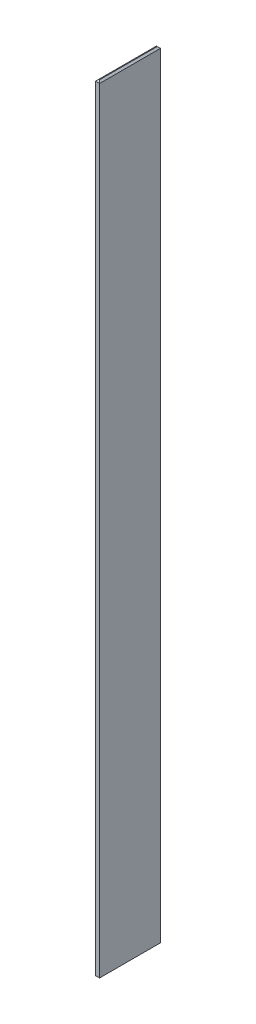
ISO-10303-21;
HEADER;
FILE_DESCRIPTION(('STEP AP214'),'2;1');
FILE_NAME('part.step','',(''),(''),'','','');
FILE_SCHEMA(('AUTOMOTIVE_DESIGN { 1 0 10303 214 1 1 1 1 }'));
ENDSEC;
DATA;
#1=APPLICATION_CONTEXT('core data for automotive mechanical design processes');
#2=APPLICATION_PROTOCOL_DEFINITION('international standard','automotive_design',2000,#1);
#3=PRODUCT_CONTEXT('',#1,'mechanical');
#4=PRODUCT('Part','Part','',(#3));
#5=PRODUCT_RELATED_PRODUCT_CATEGORY('part','',(#4));
#6=PRODUCT_DEFINITION_FORMATION('','',#4);
#7=PRODUCT_DEFINITION_CONTEXT('part definition',#1,'design');
#8=PRODUCT_DEFINITION('design','',#6,#7);
#9=PRODUCT_DEFINITION_SHAPE('','',#8);
#10=(LENGTH_UNIT() NAMED_UNIT(*) SI_UNIT(.MILLI.,.METRE.));
#11=(NAMED_UNIT(*) PLANE_ANGLE_UNIT() SI_UNIT($,.RADIAN.));
#12=(NAMED_UNIT(*) SI_UNIT($,.STERADIAN.) SOLID_ANGLE_UNIT());
#13=UNCERTAINTY_MEASURE_WITH_UNIT(LENGTH_MEASURE(1.E-05),#10,'distance_accuracy_value','');
#14=(GEOMETRIC_REPRESENTATION_CONTEXT(3) GLOBAL_UNCERTAINTY_ASSIGNED_CONTEXT((#13)) GLOBAL_UNIT_ASSIGNED_CONTEXT((#10,
#11,#12)) REPRESENTATION_CONTEXT('',''));
#15=CARTESIAN_POINT('',(0.,0.,0.));
#16=DIRECTION('',(0.,0.,1.));
#17=DIRECTION('',(1.,0.,0.));
#18=AXIS2_PLACEMENT_3D('',#15,#16,#17);
#19=CARTESIAN_POINT('',(-25.3999999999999,9739.6,380.999999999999));
#20=DIRECTION('',(1.,0.,0.));
#21=DIRECTION('',(0.,0.,-1.));
#22=AXIS2_PLACEMENT_3D('',#19,#20,#21);
#23=PLANE('',#22);
#24=DIRECTION('',(0.,-1.,0.));
#25=VECTOR('',#24,1.);
#26=CARTESIAN_POINT('',(-25.4000000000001,9739.6,-381.000000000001));
#27=LINE('',#26,#25);
#28=CARTESIAN_POINT('',(-25.4000000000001,9719.6,-381.000000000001));
#29=VERTEX_POINT('',#28);
#30=CARTESIAN_POINT('',(-25.4000000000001,20.0000000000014,-381.000000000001));
#31=VERTEX_POINT('',#30);
#32=EDGE_CURVE('E170',#29,#31,#27,.T.);
#33=ORIENTED_EDGE('',*,*,#32,.T.);
#34=DIRECTION('',(0.,0.,1.));
#35=VECTOR('',#34,1.);
#36=CARTESIAN_POINT('',(-25.3999999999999,20.0000000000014,380.999999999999));
#37=LINE('',#36,#35);
#38=CARTESIAN_POINT('',(-25.3999999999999,20.0000000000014,380.999999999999));
#39=VERTEX_POINT('',#38);
#40=EDGE_CURVE('E182',#31,#39,#37,.T.);
#41=ORIENTED_EDGE('',*,*,#40,.T.);
#42=DIRECTION('',(0.,-1.,0.));
#43=VECTOR('',#42,1.);
#44=CARTESIAN_POINT('',(-25.3999999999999,9739.6,380.999999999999));
#45=LINE('',#44,#43);
#46=CARTESIAN_POINT('',(-25.3999999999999,9719.6,380.999999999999));
#47=VERTEX_POINT('',#46);
#48=EDGE_CURVE('E139',#47,#39,#45,.T.);
#49=ORIENTED_EDGE('',*,*,#48,.F.);
#50=DIRECTION('',(0.,0.,-1.));
#51=VECTOR('',#50,1.);
#52=CARTESIAN_POINT('',(-25.4000000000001,9719.6,-381.000000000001));
#53=LINE('',#52,#51);
#54=EDGE_CURVE('E184',#47,#29,#53,.T.);
#55=ORIENTED_EDGE('',*,*,#54,.T.);
#56=EDGE_LOOP('',(#33,#41,#49,#55));
#57=FACE_BOUND('',#56,.T.);
#58=ADVANCED_FACE('F50',(#57),#23,.F.);
#59=CARTESIAN_POINT('',(25.4,9739.6,380.999999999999));
#60=DIRECTION('',(0.,0.,-1.));
#61=DIRECTION('',(-1.,0.,0.));
#62=AXIS2_PLACEMENT_3D('',#59,#60,#61);
#63=PLANE('',#62);
#64=ORIENTED_EDGE('',*,*,#48,.T.);
#65=DIRECTION('',(1.,0.,0.));
#66=VECTOR('',#65,1.);
#67=CARTESIAN_POINT('',(25.4,20.0000000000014,380.999999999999));
#68=LINE('',#67,#66);
#69=CARTESIAN_POINT('',(25.4,20.0000000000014,380.999999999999));
#70=VERTEX_POINT('',#69);
#71=EDGE_CURVE('E136',#39,#70,#68,.T.);
#72=ORIENTED_EDGE('',*,*,#71,.T.);
#73=DIRECTION('',(0.,-1.,0.));
#74=VECTOR('',#73,1.);
#75=CARTESIAN_POINT('',(25.4,9739.6,380.999999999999));
#76=LINE('',#75,#74);
#77=CARTESIAN_POINT('',(25.4,9719.6,380.999999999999));
#78=VERTEX_POINT('',#77);
#79=EDGE_CURVE('E119',#78,#70,#76,.T.);
#80=ORIENTED_EDGE('',*,*,#79,.F.);
#81=DIRECTION('',(-1.,0.,0.));
#82=VECTOR('',#81,1.);
#83=CARTESIAN_POINT('',(-25.3999999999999,9719.6,380.999999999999));
#84=LINE('',#83,#82);
#85=EDGE_CURVE('E134',#78,#47,#84,.T.);
#86=ORIENTED_EDGE('',*,*,#85,.T.);
#87=EDGE_LOOP('',(#64,#72,#80,#86));
#88=FACE_BOUND('',#87,.T.);
#89=ADVANCED_FACE('F132',(#88),#63,.F.);
#90=CARTESIAN_POINT('',(25.4,9739.6,380.999999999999));
#91=DIRECTION('',(-1.,0.,0.));
#92=DIRECTION('',(0.,0.,1.));
#93=AXIS2_PLACEMENT_3D('',#90,#91,#92);
#94=PLANE('',#93);
#95=ORIENTED_EDGE('',*,*,#79,.T.);
#96=DIRECTION('',(0.,0.,-1.));
#97=VECTOR('',#96,1.);
#98=CARTESIAN_POINT('',(25.4,20.0000000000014,380.999999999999));
#99=LINE('',#98,#97);
#100=CARTESIAN_POINT('',(25.3999999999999,20.0000000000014,-381.000000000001));
#101=VERTEX_POINT('',#100);
#102=EDGE_CURVE('E125',#70,#101,#99,.T.);
#103=ORIENTED_EDGE('',*,*,#102,.T.);
#104=DIRECTION('',(0.,-1.,0.));
#105=VECTOR('',#104,1.);
#106=CARTESIAN_POINT('',(25.3999999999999,9739.6,-381.000000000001));
#107=LINE('',#106,#105);
#108=CARTESIAN_POINT('',(25.3999999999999,9719.6,-381.000000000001));
#109=VERTEX_POINT('',#108);
#110=EDGE_CURVE('E120',#109,#101,#107,.T.);
#111=ORIENTED_EDGE('',*,*,#110,.F.);
#112=DIRECTION('',(0.,0.,1.));
#113=VECTOR('',#112,1.);
#114=CARTESIAN_POINT('',(25.4,9719.6,380.999999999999));
#115=LINE('',#114,#113);
#116=EDGE_CURVE('E113',#109,#78,#115,.T.);
#117=ORIENTED_EDGE('',*,*,#116,.T.);
#118=EDGE_LOOP('',(#95,#103,#111,#117));
#119=FACE_BOUND('',#118,.T.);
#120=ADVANCED_FACE('F117',(#119),#94,.F.);
#121=CARTESIAN_POINT('',(25.3999999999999,9739.6,-381.000000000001));
#122=DIRECTION('',(0.,0.,1.));
#123=DIRECTION('',(1.,0.,0.));
#124=AXIS2_PLACEMENT_3D('',#121,#122,#123);
#125=PLANE('',#124);
#126=ORIENTED_EDGE('',*,*,#110,.T.);
#127=DIRECTION('',(-1.,0.,0.));
#128=VECTOR('',#127,1.);
#129=CARTESIAN_POINT('',(25.3999999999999,20.0000000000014,-381.000000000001));
#130=LINE('',#129,#128);
#131=EDGE_CURVE('E187',#101,#31,#130,.T.);
#132=ORIENTED_EDGE('',*,*,#131,.T.);
#133=ORIENTED_EDGE('',*,*,#32,.F.);
#134=DIRECTION('',(1.,0.,0.));
#135=VECTOR('',#134,1.);
#136=CARTESIAN_POINT('',(25.3999999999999,9719.6,-381.000000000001));
#137=LINE('',#136,#135);
#138=EDGE_CURVE('E190',#29,#109,#137,.T.);
#139=ORIENTED_EDGE('',*,*,#138,.T.);
#140=EDGE_LOOP('',(#126,#132,#133,#139));
#141=FACE_BOUND('',#140,.T.);
#142=ADVANCED_FACE('F236',(#141),#125,.F.);
#143=CARTESIAN_POINT('',(0.,9739.6,0.));
#144=DIRECTION('',(0.,1.,0.));
#145=DIRECTION('',(0.,0.,1.));
#146=AXIS2_PLACEMENT_3D('',#143,#144,#145);
#147=PLANE('',#146);
#148=DIRECTION('',(0.,0.,-1.));
#149=VECTOR('',#148,1.);
#150=CARTESIAN_POINT('',(5.40000000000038,9739.6,-381.000000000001));
#151=LINE('',#150,#149);
#152=CARTESIAN_POINT('',(5.40000000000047,9739.6,361.));
#153=VERTEX_POINT('',#152);
#154=CARTESIAN_POINT('',(5.40000000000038,9739.6,-361.000000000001));
#155=VERTEX_POINT('',#154);
#156=EDGE_CURVE('E59',#153,#155,#151,.T.);
#157=ORIENTED_EDGE('',*,*,#156,.T.);
#158=DIRECTION('',(-1.,0.,0.));
#159=VECTOR('',#158,1.);
#160=CARTESIAN_POINT('',(-25.4000000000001,9739.6,-361.000000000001));
#161=LINE('',#160,#159);
#162=CARTESIAN_POINT('',(-5.40000000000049,9739.6,-361.000000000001));
#163=VERTEX_POINT('',#162);
#164=EDGE_CURVE('E11',#155,#163,#161,.T.);
#165=ORIENTED_EDGE('',*,*,#164,.T.);
#166=DIRECTION('',(0.,0.,1.));
#167=VECTOR('',#166,1.);
#168=CARTESIAN_POINT('',(-5.40000000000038,9739.6,380.999999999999));
#169=LINE('',#168,#167);
#170=CARTESIAN_POINT('',(-5.40000000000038,9739.6,361.));
#171=VERTEX_POINT('',#170);
#172=EDGE_CURVE('E179',#163,#171,#169,.T.);
#173=ORIENTED_EDGE('',*,*,#172,.T.);
#174=DIRECTION('',(1.,0.,0.));
#175=VECTOR('',#174,1.);
#176=CARTESIAN_POINT('',(25.4,9739.6,361.));
#177=LINE('',#176,#175);
#178=EDGE_CURVE('E68',#171,#153,#177,.T.);
#179=ORIENTED_EDGE('',*,*,#178,.T.);
#180=EDGE_LOOP('',(#157,#165,#173,#179));
#181=FACE_BOUND('',#180,.T.);
#182=ADVANCED_FACE('F243',(#181),#147,.T.);
#183=CARTESIAN_POINT('',(0.,0.,0.));
#184=DIRECTION('',(0.,1.,0.));
#185=DIRECTION('',(0.,0.,1.));
#186=AXIS2_PLACEMENT_3D('',#183,#184,#185);
#187=PLANE('',#186);
#188=DIRECTION('',(0.,0.,1.));
#189=VECTOR('',#188,1.);
#190=CARTESIAN_POINT('',(5.39999999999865,0.,0.));
#191=LINE('',#190,#189);
#192=CARTESIAN_POINT('',(5.3999999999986,0.,-360.999999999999));
#193=VERTEX_POINT('',#192);
#194=CARTESIAN_POINT('',(5.39999999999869,0.,360.999999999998));
#195=VERTEX_POINT('',#194);
#196=EDGE_CURVE('E196',#193,#195,#191,.T.);
#197=ORIENTED_EDGE('',*,*,#196,.T.);
#198=DIRECTION('',(-1.,0.,0.));
#199=VECTOR('',#198,1.);
#200=CARTESIAN_POINT('',(0.,0.,360.999999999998));
#201=LINE('',#200,#199);
#202=CARTESIAN_POINT('',(-5.3999999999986,0.,360.999999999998));
#203=VERTEX_POINT('',#202);
#204=EDGE_CURVE('E127',#195,#203,#201,.T.);
#205=ORIENTED_EDGE('',*,*,#204,.T.);
#206=DIRECTION('',(0.,0.,-1.));
#207=VECTOR('',#206,1.);
#208=CARTESIAN_POINT('',(-5.39999999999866,0.,0.));
#209=LINE('',#208,#207);
#210=CARTESIAN_POINT('',(-5.39999999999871,0.,-360.999999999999));
#211=VERTEX_POINT('',#210);
#212=EDGE_CURVE('E204',#203,#211,#209,.T.);
#213=ORIENTED_EDGE('',*,*,#212,.T.);
#214=DIRECTION('',(1.,0.,0.));
#215=VECTOR('',#214,1.);
#216=CARTESIAN_POINT('',(0.,0.,-360.999999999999));
#217=LINE('',#216,#215);
#218=EDGE_CURVE('E203',#211,#193,#217,.T.);
#219=ORIENTED_EDGE('',*,*,#218,.T.);
#220=EDGE_LOOP('',(#197,#205,#213,#219));
#221=FACE_BOUND('',#220,.T.);
#222=ADVANCED_FACE('F246',(#221),#187,.F.);
#223=CARTESIAN_POINT('',(25.3999999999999,20.0000000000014,-381.000000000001));
#224=DIRECTION('',(0.,0.707106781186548,0.707106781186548));
#225=DIRECTION('',(-1.,0.,0.));
#226=AXIS2_PLACEMENT_3D('',#223,#224,#225);
#227=PLANE('',#226);
#228=DIRECTION('',(-0.577350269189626,-0.577350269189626,0.577350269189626));
#229=VECTOR('',#228,1.);
#230=CARTESIAN_POINT('',(25.3999999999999,20.0000000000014,-381.000000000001));
#231=LINE('',#230,#229);
#232=EDGE_CURVE('E169',#193,#101,#231,.F.);
#233=ORIENTED_EDGE('',*,*,#232,.F.);
#234=ORIENTED_EDGE('',*,*,#218,.F.);
#235=DIRECTION('',(0.577350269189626,-0.577350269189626,0.577350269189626));
#236=VECTOR('',#235,1.);
#237=CARTESIAN_POINT('',(228.6,-233.999999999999,-127.));
#238=LINE('',#237,#236);
#239=EDGE_CURVE('E162',#31,#211,#238,.T.);
#240=ORIENTED_EDGE('',*,*,#239,.F.);
#241=ORIENTED_EDGE('',*,*,#131,.F.);
#242=EDGE_LOOP('',(#233,#234,#240,#241));
#243=FACE_BOUND('',#242,.T.);
#244=ADVANCED_FACE('F223',(#243),#227,.F.);
#245=CARTESIAN_POINT('',(-25.3999999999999,20.0000000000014,380.999999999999));
#246=DIRECTION('',(0.707106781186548,0.707106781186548,0.));
#247=DIRECTION('',(0.,0.,1.));
#248=AXIS2_PLACEMENT_3D('',#245,#246,#247);
#249=PLANE('',#248);
#250=ORIENTED_EDGE('',*,*,#239,.T.);
#251=ORIENTED_EDGE('',*,*,#212,.F.);
#252=DIRECTION('',(-0.577350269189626,0.577350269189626,0.577350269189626));
#253=VECTOR('',#252,1.);
#254=CARTESIAN_POINT('',(-25.3999999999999,20.0000000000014,380.999999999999));
#255=LINE('',#254,#253);
#256=EDGE_CURVE('E155',#39,#203,#255,.F.);
#257=ORIENTED_EDGE('',*,*,#256,.F.);
#258=ORIENTED_EDGE('',*,*,#40,.F.);
#259=EDGE_LOOP('',(#250,#251,#257,#258));
#260=FACE_BOUND('',#259,.T.);
#261=ADVANCED_FACE('F228',(#260),#249,.F.);
#262=CARTESIAN_POINT('',(25.4,20.0000000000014,380.999999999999));
#263=DIRECTION('',(-0.707106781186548,0.707106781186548,0.));
#264=DIRECTION('',(0.,0.,-1.));
#265=AXIS2_PLACEMENT_3D('',#262,#263,#264);
#266=PLANE('',#265);
#267=ORIENTED_EDGE('',*,*,#232,.T.);
#268=ORIENTED_EDGE('',*,*,#102,.F.);
#269=DIRECTION('',(-0.577350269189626,-0.577350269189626,-0.577350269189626));
#270=VECTOR('',#269,1.);
#271=CARTESIAN_POINT('',(25.4,20.0000000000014,380.999999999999));
#272=LINE('',#271,#270);
#273=EDGE_CURVE('E149',#195,#70,#272,.F.);
#274=ORIENTED_EDGE('',*,*,#273,.F.);
#275=ORIENTED_EDGE('',*,*,#196,.F.);
#276=EDGE_LOOP('',(#267,#268,#274,#275));
#277=FACE_BOUND('',#276,.T.);
#278=ADVANCED_FACE('F240',(#277),#266,.F.);
#279=CARTESIAN_POINT('',(25.4,20.0000000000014,380.999999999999));
#280=DIRECTION('',(0.,0.707106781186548,-0.707106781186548));
#281=DIRECTION('',(1.,0.,0.));
#282=AXIS2_PLACEMENT_3D('',#279,#280,#281);
#283=PLANE('',#282);
#284=ORIENTED_EDGE('',*,*,#256,.T.);
#285=ORIENTED_EDGE('',*,*,#204,.F.);
#286=ORIENTED_EDGE('',*,*,#273,.T.);
#287=ORIENTED_EDGE('',*,*,#71,.F.);
#288=EDGE_LOOP('',(#284,#285,#286,#287));
#289=FACE_BOUND('',#288,.T.);
#290=ADVANCED_FACE('F232',(#289),#283,.F.);
#291=CARTESIAN_POINT('',(0.,9739.6,361.));
#292=DIRECTION('',(0.,0.707106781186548,0.707106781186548));
#293=DIRECTION('',(-1.,0.,0.));
#294=AXIS2_PLACEMENT_3D('',#291,#292,#293);
#295=PLANE('',#294);
#296=DIRECTION('',(0.577350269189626,0.577350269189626,-0.577350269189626));
#297=VECTOR('',#296,1.);
#298=CARTESIAN_POINT('',(114.933333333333,9859.93333333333,240.666666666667));
#299=LINE('',#298,#297);
#300=EDGE_CURVE('E141',#47,#171,#299,.T.);
#301=ORIENTED_EDGE('',*,*,#300,.F.);
#302=ORIENTED_EDGE('',*,*,#85,.F.);
#303=DIRECTION('',(-0.577350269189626,0.577350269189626,-0.577350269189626));
#304=VECTOR('',#303,1.);
#305=CARTESIAN_POINT('',(3.60000000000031,9741.4,359.2));
#306=LINE('',#305,#304);
#307=EDGE_CURVE('E55',#153,#78,#306,.F.);
#308=ORIENTED_EDGE('',*,*,#307,.F.);
#309=ORIENTED_EDGE('',*,*,#178,.F.);
#310=EDGE_LOOP('',(#301,#302,#308,#309));
#311=FACE_BOUND('',#310,.T.);
#312=ADVANCED_FACE('F49',(#311),#295,.T.);
#313=CARTESIAN_POINT('',(5.40000000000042,9739.6,0.));
#314=DIRECTION('',(0.707106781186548,0.707106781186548,0.));
#315=DIRECTION('',(0.,0.,1.));
#316=AXIS2_PLACEMENT_3D('',#313,#314,#315);
#317=PLANE('',#316);
#318=ORIENTED_EDGE('',*,*,#307,.T.);
#319=ORIENTED_EDGE('',*,*,#116,.F.);
#320=DIRECTION('',(-0.577350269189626,0.577350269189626,0.577350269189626));
#321=VECTOR('',#320,1.);
#322=CARTESIAN_POINT('',(-114.933333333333,9859.93333333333,-240.666666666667));
#323=LINE('',#322,#321);
#324=EDGE_CURVE('E152',#155,#109,#323,.F.);
#325=ORIENTED_EDGE('',*,*,#324,.F.);
#326=ORIENTED_EDGE('',*,*,#156,.F.);
#327=EDGE_LOOP('',(#318,#319,#325,#326));
#328=FACE_BOUND('',#327,.T.);
#329=ADVANCED_FACE('F150',(#328),#317,.T.);
#330=CARTESIAN_POINT('',(-5.40000000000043,9739.6,0.));
#331=DIRECTION('',(-0.707106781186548,0.707106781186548,0.));
#332=DIRECTION('',(0.,0.,-1.));
#333=AXIS2_PLACEMENT_3D('',#330,#331,#332);
#334=PLANE('',#333);
#335=ORIENTED_EDGE('',*,*,#300,.T.);
#336=ORIENTED_EDGE('',*,*,#172,.F.);
#337=DIRECTION('',(-0.577350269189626,-0.577350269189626,-0.577350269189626));
#338=VECTOR('',#337,1.);
#339=CARTESIAN_POINT('',(114.933333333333,9859.93333333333,-240.666666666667));
#340=LINE('',#339,#338);
#341=EDGE_CURVE('E158',#29,#163,#340,.F.);
#342=ORIENTED_EDGE('',*,*,#341,.F.);
#343=ORIENTED_EDGE('',*,*,#54,.F.);
#344=EDGE_LOOP('',(#335,#336,#342,#343));
#345=FACE_BOUND('',#344,.T.);
#346=ADVANCED_FACE('F244',(#345),#334,.T.);
#347=CARTESIAN_POINT('',(0.,9739.6,-361.000000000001));
#348=DIRECTION('',(0.,0.707106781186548,-0.707106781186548));
#349=DIRECTION('',(1.,0.,0.));
#350=AXIS2_PLACEMENT_3D('',#347,#348,#349);
#351=PLANE('',#350);
#352=ORIENTED_EDGE('',*,*,#324,.T.);
#353=ORIENTED_EDGE('',*,*,#138,.F.);
#354=ORIENTED_EDGE('',*,*,#341,.T.);
#355=ORIENTED_EDGE('',*,*,#164,.F.);
#356=EDGE_LOOP('',(#352,#353,#354,#355));
#357=FACE_BOUND('',#356,.T.);
#358=ADVANCED_FACE('F241',(#357),#351,.T.);
#359=CLOSED_SHELL('',(#58,#89,#120,#142,#182,#222,#244,#261,#278,#290,#312,#329,#346,#358));
#360=MANIFOLD_SOLID_BREP('B2',#359);
#361=ADVANCED_BREP_SHAPE_REPRESENTATION('',(#18,#360),#14);
#362=SHAPE_DEFINITION_REPRESENTATION(#9,#361);
ENDSEC;
END-ISO-10303-21;
